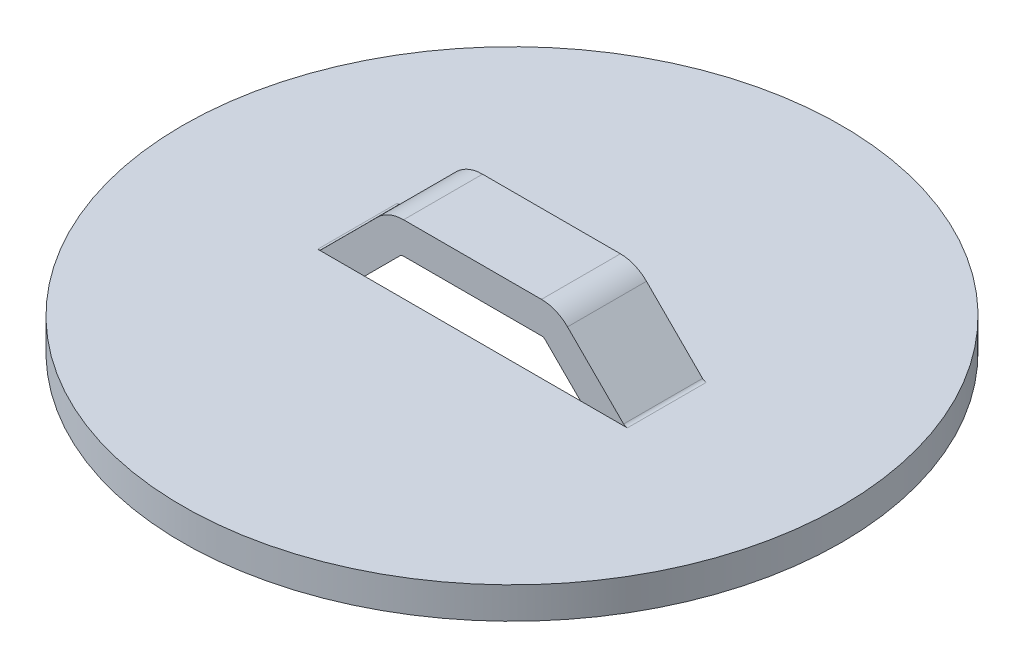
ISO-10303-21;
HEADER;
FILE_DESCRIPTION(('STEP AP214'),'2;1');
FILE_NAME('part.step','',(''),(''),'','','');
FILE_SCHEMA(('AUTOMOTIVE_DESIGN { 1 0 10303 214 1 1 1 1 }'));
ENDSEC;
DATA;
#1=APPLICATION_CONTEXT('core data for automotive mechanical design processes');
#2=APPLICATION_PROTOCOL_DEFINITION('international standard','automotive_design',2000,#1);
#3=PRODUCT_CONTEXT('',#1,'mechanical');
#4=PRODUCT('Part','Part','',(#3));
#5=PRODUCT_RELATED_PRODUCT_CATEGORY('part','',(#4));
#6=PRODUCT_DEFINITION_FORMATION('','',#4);
#7=PRODUCT_DEFINITION_CONTEXT('part definition',#1,'design');
#8=PRODUCT_DEFINITION('design','',#6,#7);
#9=PRODUCT_DEFINITION_SHAPE('','',#8);
#10=(LENGTH_UNIT() NAMED_UNIT(*) SI_UNIT(.MILLI.,.METRE.));
#11=(NAMED_UNIT(*) PLANE_ANGLE_UNIT() SI_UNIT($,.RADIAN.));
#12=(NAMED_UNIT(*) SI_UNIT($,.STERADIAN.) SOLID_ANGLE_UNIT());
#13=UNCERTAINTY_MEASURE_WITH_UNIT(LENGTH_MEASURE(1.E-05),#10,'distance_accuracy_value','');
#14=(GEOMETRIC_REPRESENTATION_CONTEXT(3) GLOBAL_UNCERTAINTY_ASSIGNED_CONTEXT((#13)) GLOBAL_UNIT_ASSIGNED_CONTEXT((#10,
#11,#12)) REPRESENTATION_CONTEXT('',''));
#15=CARTESIAN_POINT('',(0.,0.,0.));
#16=DIRECTION('',(0.,0.,1.));
#17=DIRECTION('',(1.,0.,0.));
#18=AXIS2_PLACEMENT_3D('',#15,#16,#17);
#19=CARTESIAN_POINT('',(-7.47121024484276,0.254,0.));
#20=DIRECTION('',(0.,0.,-1.));
#21=DIRECTION('',(-1.,0.,0.));
#22=AXIS2_PLACEMENT_3D('',#19,#20,#21);
#23=PLANE('',#22);
#24=DIRECTION('',(-1.,0.,0.));
#25=VECTOR('',#24,1.);
#26=CARTESIAN_POINT('',(-7.47121024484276,0.,0.));
#27=LINE('',#26,#25);
#28=CARTESIAN_POINT('',(-5.21073853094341,0.,0.));
#29=VERTEX_POINT('',#28);
#30=CARTESIAN_POINT('',(-7.47121024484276,0.,0.));
#31=VERTEX_POINT('',#30);
#32=EDGE_CURVE('E174',#29,#31,#27,.T.);
#33=ORIENTED_EDGE('',*,*,#32,.F.);
#34=DIRECTION('',(0.707106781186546,0.707106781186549,0.));
#35=VECTOR('',#34,1.);
#36=CARTESIAN_POINT('',(-6.21397438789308,-1.00323585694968,0.));
#37=LINE('',#36,#35);
#38=CARTESIAN_POINT('',(-3.50713340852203,1.70360512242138,0.));
#39=VERTEX_POINT('',#38);
#40=EDGE_CURVE('E219',#39,#29,#37,.F.);
#41=ORIENTED_EDGE('',*,*,#40,.F.);
#42=CARTESIAN_POINT('',(-3.32752828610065,1.524,0.));
#43=DIRECTION('',(0.,0.,1.));
#44=DIRECTION('',(1.,0.,0.));
#45=AXIS2_PLACEMENT_3D('',#42,#43,#44);
#46=CIRCLE('',#45,0.254);
#47=CARTESIAN_POINT('',(-3.32752828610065,1.778,0.));
#48=VERTEX_POINT('',#47);
#49=EDGE_CURVE('E223',#39,#48,#46,.F.);
#50=ORIENTED_EDGE('',*,*,#49,.T.);
#51=DIRECTION('',(1.,0.,0.));
#52=VECTOR('',#51,1.);
#53=CARTESIAN_POINT('',(-3.32752828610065,1.778,0.));
#54=LINE('',#53,#52);
#55=CARTESIAN_POINT('',(3.32752828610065,1.778,0.));
#56=VERTEX_POINT('',#55);
#57=EDGE_CURVE('E224',#56,#48,#54,.F.);
#58=ORIENTED_EDGE('',*,*,#57,.F.);
#59=CARTESIAN_POINT('',(3.32752828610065,1.524,0.));
#60=DIRECTION('',(0.,0.,1.));
#61=DIRECTION('',(1.,0.,0.));
#62=AXIS2_PLACEMENT_3D('',#59,#60,#61);
#63=CIRCLE('',#62,0.253999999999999);
#64=CARTESIAN_POINT('',(3.50713340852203,1.70360512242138,0.));
#65=VERTEX_POINT('',#64);
#66=EDGE_CURVE('E227',#56,#65,#63,.F.);
#67=ORIENTED_EDGE('',*,*,#66,.T.);
#68=DIRECTION('',(0.707106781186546,-0.707106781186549,0.));
#69=VECTOR('',#68,1.);
#70=CARTESIAN_POINT('',(3.50713340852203,1.70360512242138,0.));
#71=LINE('',#70,#69);
#72=CARTESIAN_POINT('',(5.21073853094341,0.,0.));
#73=VERTEX_POINT('',#72);
#74=EDGE_CURVE('E169',#73,#65,#71,.F.);
#75=ORIENTED_EDGE('',*,*,#74,.F.);
#76=CARTESIAN_POINT('',(7.47121024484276,0.,0.));
#77=VERTEX_POINT('',#76);
#78=EDGE_CURVE('E53',#77,#73,#27,.T.);
#79=ORIENTED_EDGE('',*,*,#78,.F.);
#80=CARTESIAN_POINT('',(7.47121024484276,0.254,0.));
#81=DIRECTION('',(0.,0.,1.));
#82=DIRECTION('',(1.,0.,0.));
#83=AXIS2_PLACEMENT_3D('',#80,#81,#82);
#84=CIRCLE('',#83,0.253999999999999);
#85=CARTESIAN_POINT('',(7.29160512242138,0.0743948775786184,0.));
#86=VERTEX_POINT('',#85);
#87=EDGE_CURVE('E166',#77,#86,#84,.F.);
#88=ORIENTED_EDGE('',*,*,#87,.T.);
#89=DIRECTION('',(-0.707106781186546,0.707106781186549,0.));
#90=VECTOR('',#89,1.);
#91=CARTESIAN_POINT('',(4.58476414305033,2.78123585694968,0.));
#92=LINE('',#91,#90);
#93=CARTESIAN_POINT('',(4.58476414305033,2.78123585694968,0.));
#94=VERTEX_POINT('',#93);
#95=EDGE_CURVE('E197',#94,#86,#92,.F.);
#96=ORIENTED_EDGE('',*,*,#95,.F.);
#97=CARTESIAN_POINT('',(3.32752828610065,1.524,0.));
#98=DIRECTION('',(0.,0.,1.));
#99=DIRECTION('',(1.,0.,0.));
#100=AXIS2_PLACEMENT_3D('',#97,#98,#99);
#101=CIRCLE('',#100,1.778);
#102=CARTESIAN_POINT('',(3.32752828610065,3.302,0.));
#103=VERTEX_POINT('',#102);
#104=EDGE_CURVE('E201',#103,#94,#101,.F.);
#105=ORIENTED_EDGE('',*,*,#104,.F.);
#106=DIRECTION('',(1.,0.,0.));
#107=VECTOR('',#106,1.);
#108=CARTESIAN_POINT('',(-3.32752828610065,3.302,0.));
#109=LINE('',#108,#107);
#110=CARTESIAN_POINT('',(-3.32752828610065,3.302,0.));
#111=VERTEX_POINT('',#110);
#112=EDGE_CURVE('E205',#111,#103,#109,.T.);
#113=ORIENTED_EDGE('',*,*,#112,.F.);
#114=CARTESIAN_POINT('',(-3.32752828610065,1.524,0.));
#115=DIRECTION('',(0.,0.,1.));
#116=DIRECTION('',(1.,0.,0.));
#117=AXIS2_PLACEMENT_3D('',#114,#115,#116);
#118=CIRCLE('',#117,1.778);
#119=CARTESIAN_POINT('',(-4.58476414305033,2.78123585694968,0.));
#120=VERTEX_POINT('',#119);
#121=EDGE_CURVE('E209',#120,#111,#118,.F.);
#122=ORIENTED_EDGE('',*,*,#121,.F.);
#123=DIRECTION('',(-0.707106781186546,-0.707106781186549,0.));
#124=VECTOR('',#123,1.);
#125=CARTESIAN_POINT('',(-7.29160512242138,0.0743948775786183,0.));
#126=LINE('',#125,#124);
#127=CARTESIAN_POINT('',(-7.29160512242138,0.0743948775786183,0.));
#128=VERTEX_POINT('',#127);
#129=EDGE_CURVE('E213',#128,#120,#126,.F.);
#130=ORIENTED_EDGE('',*,*,#129,.F.);
#131=CARTESIAN_POINT('',(-7.47121024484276,0.254,0.));
#132=DIRECTION('',(0.,0.,1.));
#133=DIRECTION('',(1.,0.,0.));
#134=AXIS2_PLACEMENT_3D('',#131,#132,#133);
#135=CIRCLE('',#134,0.253999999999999);
#136=EDGE_CURVE('E217',#128,#31,#135,.F.);
#137=ORIENTED_EDGE('',*,*,#136,.T.);
#138=EDGE_LOOP('',(#33,#41,#50,#58,#67,#75,#79,#88,#96,#105,#113,#122,#130,#137));
#139=FACE_BOUND('',#138,.T.);
#140=ADVANCED_FACE('F39',(#139),#23,.F.);
#141=CARTESIAN_POINT('',(-7.47121024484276,0.254,-3.81));
#142=DIRECTION('',(0.,0.,-1.));
#143=DIRECTION('',(-1.,0.,0.));
#144=AXIS2_PLACEMENT_3D('',#141,#142,#143);
#145=PLANE('',#144);
#146=DIRECTION('',(-0.707106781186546,-0.707106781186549,0.));
#147=VECTOR('',#146,1.);
#148=CARTESIAN_POINT('',(-3.50713340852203,1.70360512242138,-3.81));
#149=LINE('',#148,#147);
#150=CARTESIAN_POINT('',(-3.50713340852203,1.70360512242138,-3.81));
#151=VERTEX_POINT('',#150);
#152=CARTESIAN_POINT('',(-5.21073853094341,0.,-3.81));
#153=VERTEX_POINT('',#152);
#154=EDGE_CURVE('E238',#151,#153,#149,.T.);
#155=ORIENTED_EDGE('',*,*,#154,.T.);
#156=DIRECTION('',(1.,0.,0.));
#157=VECTOR('',#156,1.);
#158=CARTESIAN_POINT('',(-7.47121024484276,0.,-3.81));
#159=LINE('',#158,#157);
#160=CARTESIAN_POINT('',(-7.47121024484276,0.,-3.81));
#161=VERTEX_POINT('',#160);
#162=EDGE_CURVE('E285',#161,#153,#159,.T.);
#163=ORIENTED_EDGE('',*,*,#162,.F.);
#164=CARTESIAN_POINT('',(-7.47121024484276,0.254,-3.81));
#165=DIRECTION('',(0.,0.,1.));
#166=DIRECTION('',(1.,0.,0.));
#167=AXIS2_PLACEMENT_3D('',#164,#165,#166);
#168=CIRCLE('',#167,0.253999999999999);
#169=CARTESIAN_POINT('',(-7.29160512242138,0.0743948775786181,-3.81));
#170=VERTEX_POINT('',#169);
#171=EDGE_CURVE('E262',#161,#170,#168,.T.);
#172=ORIENTED_EDGE('',*,*,#171,.T.);
#173=DIRECTION('',(0.707106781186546,0.707106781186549,0.));
#174=VECTOR('',#173,1.);
#175=CARTESIAN_POINT('',(-7.29160512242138,0.074394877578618,-3.81));
#176=LINE('',#175,#174);
#177=CARTESIAN_POINT('',(-4.58476414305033,2.78123585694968,-3.81));
#178=VERTEX_POINT('',#177);
#179=EDGE_CURVE('E261',#170,#178,#176,.T.);
#180=ORIENTED_EDGE('',*,*,#179,.T.);
#181=CARTESIAN_POINT('',(-3.32752828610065,1.524,-3.81));
#182=DIRECTION('',(0.,0.,1.));
#183=DIRECTION('',(1.,0.,0.));
#184=AXIS2_PLACEMENT_3D('',#181,#182,#183);
#185=CIRCLE('',#184,1.778);
#186=CARTESIAN_POINT('',(-3.32752828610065,3.302,-3.81));
#187=VERTEX_POINT('',#186);
#188=EDGE_CURVE('E258',#178,#187,#185,.F.);
#189=ORIENTED_EDGE('',*,*,#188,.T.);
#190=DIRECTION('',(-1.,0.,0.));
#191=VECTOR('',#190,1.);
#192=CARTESIAN_POINT('',(-7.47121024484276,3.302,-3.81));
#193=LINE('',#192,#191);
#194=CARTESIAN_POINT('',(3.32752828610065,3.302,-3.81));
#195=VERTEX_POINT('',#194);
#196=EDGE_CURVE('E257',#187,#195,#193,.F.);
#197=ORIENTED_EDGE('',*,*,#196,.T.);
#198=CARTESIAN_POINT('',(3.32752828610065,1.524,-3.81));
#199=DIRECTION('',(0.,0.,1.));
#200=DIRECTION('',(1.,0.,0.));
#201=AXIS2_PLACEMENT_3D('',#198,#199,#200);
#202=CIRCLE('',#201,1.778);
#203=CARTESIAN_POINT('',(4.58476414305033,2.78123585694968,-3.81));
#204=VERTEX_POINT('',#203);
#205=EDGE_CURVE('E254',#195,#204,#202,.F.);
#206=ORIENTED_EDGE('',*,*,#205,.T.);
#207=DIRECTION('',(0.707106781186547,-0.707106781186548,0.));
#208=VECTOR('',#207,1.);
#209=CARTESIAN_POINT('',(4.58476414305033,2.78123585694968,-3.81));
#210=LINE('',#209,#208);
#211=CARTESIAN_POINT('',(7.29160512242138,0.0743948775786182,-3.81));
#212=VERTEX_POINT('',#211);
#213=EDGE_CURVE('E253',#204,#212,#210,.T.);
#214=ORIENTED_EDGE('',*,*,#213,.T.);
#215=CARTESIAN_POINT('',(7.47121024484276,0.254,-3.81));
#216=DIRECTION('',(0.,0.,1.));
#217=DIRECTION('',(1.,0.,0.));
#218=AXIS2_PLACEMENT_3D('',#215,#216,#217);
#219=CIRCLE('',#218,0.253999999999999);
#220=CARTESIAN_POINT('',(7.47121024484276,0.,-3.81));
#221=VERTEX_POINT('',#220);
#222=EDGE_CURVE('E251',#212,#221,#219,.T.);
#223=ORIENTED_EDGE('',*,*,#222,.T.);
#224=DIRECTION('',(-1.,0.,0.));
#225=VECTOR('',#224,1.);
#226=CARTESIAN_POINT('',(-7.47121024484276,0.,-3.81));
#227=LINE('',#226,#225);
#228=CARTESIAN_POINT('',(5.21073853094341,0.,-3.81));
#229=VERTEX_POINT('',#228);
#230=EDGE_CURVE('E11',#221,#229,#227,.T.);
#231=ORIENTED_EDGE('',*,*,#230,.T.);
#232=DIRECTION('',(-0.707106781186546,0.707106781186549,0.));
#233=VECTOR('',#232,1.);
#234=CARTESIAN_POINT('',(6.21397438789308,-1.00323585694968,-3.81));
#235=LINE('',#234,#233);
#236=CARTESIAN_POINT('',(3.50713340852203,1.70360512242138,-3.81));
#237=VERTEX_POINT('',#236);
#238=EDGE_CURVE('E250',#229,#237,#235,.T.);
#239=ORIENTED_EDGE('',*,*,#238,.T.);
#240=CARTESIAN_POINT('',(3.32752828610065,1.524,-3.81));
#241=DIRECTION('',(0.,0.,1.));
#242=DIRECTION('',(1.,0.,0.));
#243=AXIS2_PLACEMENT_3D('',#240,#241,#242);
#244=CIRCLE('',#243,0.253999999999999);
#245=CARTESIAN_POINT('',(3.32752828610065,1.778,-3.81));
#246=VERTEX_POINT('',#245);
#247=EDGE_CURVE('E243',#237,#246,#244,.T.);
#248=ORIENTED_EDGE('',*,*,#247,.T.);
#249=DIRECTION('',(-1.,0.,0.));
#250=VECTOR('',#249,1.);
#251=CARTESIAN_POINT('',(-7.47121024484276,1.778,-3.81));
#252=LINE('',#251,#250);
#253=CARTESIAN_POINT('',(-3.32752828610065,1.778,-3.81));
#254=VERTEX_POINT('',#253);
#255=EDGE_CURVE('E242',#246,#254,#252,.T.);
#256=ORIENTED_EDGE('',*,*,#255,.T.);
#257=CARTESIAN_POINT('',(-3.32752828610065,1.524,-3.81));
#258=DIRECTION('',(0.,0.,1.));
#259=DIRECTION('',(1.,0.,0.));
#260=AXIS2_PLACEMENT_3D('',#257,#258,#259);
#261=CIRCLE('',#260,0.254);
#262=EDGE_CURVE('E239',#254,#151,#261,.T.);
#263=ORIENTED_EDGE('',*,*,#262,.T.);
#264=EDGE_LOOP('',(#155,#163,#172,#180,#189,#197,#206,#214,#223,#231,#239,#248,#256,#263));
#265=FACE_BOUND('',#264,.T.);
#266=ADVANCED_FACE('F355',(#265),#145,.T.);
#267=CARTESIAN_POINT('',(-7.47121024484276,0.254,-3.81));
#268=DIRECTION('',(0.,0.,1.));
#269=DIRECTION('',(1.,0.,0.));
#270=AXIS2_PLACEMENT_3D('',#267,#268,#269);
#271=CYLINDRICAL_SURFACE('',#270,0.253999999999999);
#272=DIRECTION('',(0.,0.,1.));
#273=VECTOR('',#272,1.);
#274=CARTESIAN_POINT('',(-7.29160512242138,0.0743948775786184,-3.81));
#275=LINE('',#274,#273);
#276=EDGE_CURVE('E210',#170,#128,#275,.T.);
#277=ORIENTED_EDGE('',*,*,#276,.F.);
#278=ORIENTED_EDGE('',*,*,#171,.F.);
#279=DIRECTION('',(0.,0.,1.));
#280=VECTOR('',#279,1.);
#281=CARTESIAN_POINT('',(-7.47121024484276,0.,-3.81));
#282=LINE('',#281,#280);
#283=EDGE_CURVE('E214',#31,#161,#282,.F.);
#284=ORIENTED_EDGE('',*,*,#283,.F.);
#285=ORIENTED_EDGE('',*,*,#136,.F.);
#286=EDGE_LOOP('',(#277,#278,#284,#285));
#287=FACE_BOUND('',#286,.T.);
#288=ADVANCED_FACE('F283',(#287),#271,.F.);
#289=CARTESIAN_POINT('',(-7.29160512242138,0.0743948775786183,-3.81));
#290=DIRECTION('',(-0.707106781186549,0.707106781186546,0.));
#291=DIRECTION('',(-0.707106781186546,-0.707106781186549,0.));
#292=AXIS2_PLACEMENT_3D('',#289,#290,#291);
#293=PLANE('',#292);
#294=ORIENTED_EDGE('',*,*,#179,.F.);
#295=ORIENTED_EDGE('',*,*,#276,.T.);
#296=ORIENTED_EDGE('',*,*,#129,.T.);
#297=DIRECTION('',(0.,0.,1.));
#298=VECTOR('',#297,1.);
#299=CARTESIAN_POINT('',(-4.58476414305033,2.78123585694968,-3.81));
#300=LINE('',#299,#298);
#301=EDGE_CURVE('E206',#178,#120,#300,.T.);
#302=ORIENTED_EDGE('',*,*,#301,.F.);
#303=EDGE_LOOP('',(#294,#295,#296,#302));
#304=FACE_BOUND('',#303,.T.);
#305=ADVANCED_FACE('F364',(#304),#293,.T.);
#306=CARTESIAN_POINT('',(-3.32752828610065,1.524,-3.81));
#307=DIRECTION('',(0.,0.,1.));
#308=DIRECTION('',(1.,0.,0.));
#309=AXIS2_PLACEMENT_3D('',#306,#307,#308);
#310=CYLINDRICAL_SURFACE('',#309,1.778);
#311=ORIENTED_EDGE('',*,*,#188,.F.);
#312=ORIENTED_EDGE('',*,*,#301,.T.);
#313=ORIENTED_EDGE('',*,*,#121,.T.);
#314=DIRECTION('',(0.,0.,1.));
#315=VECTOR('',#314,1.);
#316=CARTESIAN_POINT('',(-3.32752828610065,3.302,-3.81));
#317=LINE('',#316,#315);
#318=EDGE_CURVE('E202',#187,#111,#317,.T.);
#319=ORIENTED_EDGE('',*,*,#318,.F.);
#320=EDGE_LOOP('',(#311,#312,#313,#319));
#321=FACE_BOUND('',#320,.T.);
#322=ADVANCED_FACE('F407',(#321),#310,.T.);
#323=CARTESIAN_POINT('',(-3.32752828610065,3.302,-3.81));
#324=DIRECTION('',(0.,1.,0.));
#325=DIRECTION('',(0.,0.,1.));
#326=AXIS2_PLACEMENT_3D('',#323,#324,#325);
#327=PLANE('',#326);
#328=ORIENTED_EDGE('',*,*,#196,.F.);
#329=ORIENTED_EDGE('',*,*,#318,.T.);
#330=ORIENTED_EDGE('',*,*,#112,.T.);
#331=DIRECTION('',(0.,0.,1.));
#332=VECTOR('',#331,1.);
#333=CARTESIAN_POINT('',(3.32752828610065,3.302,-3.81));
#334=LINE('',#333,#332);
#335=EDGE_CURVE('E198',#195,#103,#334,.T.);
#336=ORIENTED_EDGE('',*,*,#335,.F.);
#337=EDGE_LOOP('',(#328,#329,#330,#336));
#338=FACE_BOUND('',#337,.T.);
#339=ADVANCED_FACE('F403',(#338),#327,.T.);
#340=CARTESIAN_POINT('',(3.32752828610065,1.524,-3.81));
#341=DIRECTION('',(0.,0.,1.));
#342=DIRECTION('',(1.,0.,0.));
#343=AXIS2_PLACEMENT_3D('',#340,#341,#342);
#344=CYLINDRICAL_SURFACE('',#343,1.778);
#345=ORIENTED_EDGE('',*,*,#205,.F.);
#346=ORIENTED_EDGE('',*,*,#335,.T.);
#347=ORIENTED_EDGE('',*,*,#104,.T.);
#348=DIRECTION('',(0.,0.,1.));
#349=VECTOR('',#348,1.);
#350=CARTESIAN_POINT('',(4.58476414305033,2.78123585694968,-3.81));
#351=LINE('',#350,#349);
#352=EDGE_CURVE('E194',#204,#94,#351,.T.);
#353=ORIENTED_EDGE('',*,*,#352,.F.);
#354=EDGE_LOOP('',(#345,#346,#347,#353));
#355=FACE_BOUND('',#354,.T.);
#356=ADVANCED_FACE('F399',(#355),#344,.T.);
#357=CARTESIAN_POINT('',(4.58476414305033,2.78123585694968,-3.81));
#358=DIRECTION('',(0.707106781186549,0.707106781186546,0.));
#359=DIRECTION('',(-0.707106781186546,0.707106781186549,0.));
#360=AXIS2_PLACEMENT_3D('',#357,#358,#359);
#361=PLANE('',#360);
#362=ORIENTED_EDGE('',*,*,#213,.F.);
#363=ORIENTED_EDGE('',*,*,#352,.T.);
#364=ORIENTED_EDGE('',*,*,#95,.T.);
#365=DIRECTION('',(0.,0.,1.));
#366=VECTOR('',#365,1.);
#367=CARTESIAN_POINT('',(7.29160512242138,0.0743948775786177,-3.81));
#368=LINE('',#367,#366);
#369=EDGE_CURVE('E180',#86,#212,#368,.F.);
#370=ORIENTED_EDGE('',*,*,#369,.T.);
#371=EDGE_LOOP('',(#362,#363,#364,#370));
#372=FACE_BOUND('',#371,.T.);
#373=ADVANCED_FACE('F396',(#372),#361,.T.);
#374=CARTESIAN_POINT('',(7.47121024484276,0.254,-3.81));
#375=DIRECTION('',(0.,0.,1.));
#376=DIRECTION('',(1.,0.,0.));
#377=AXIS2_PLACEMENT_3D('',#374,#375,#376);
#378=CYLINDRICAL_SURFACE('',#377,0.253999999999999);
#379=DIRECTION('',(0.,0.,1.));
#380=VECTOR('',#379,1.);
#381=CARTESIAN_POINT('',(7.47121024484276,0.,-3.81));
#382=LINE('',#381,#380);
#383=EDGE_CURVE('E178',#221,#77,#382,.T.);
#384=ORIENTED_EDGE('',*,*,#383,.F.);
#385=ORIENTED_EDGE('',*,*,#222,.F.);
#386=ORIENTED_EDGE('',*,*,#369,.F.);
#387=ORIENTED_EDGE('',*,*,#87,.F.);
#388=EDGE_LOOP('',(#384,#385,#386,#387));
#389=FACE_BOUND('',#388,.T.);
#390=ADVANCED_FACE('F176',(#389),#378,.F.);
#391=CARTESIAN_POINT('',(7.47121024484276,0.,-3.81));
#392=DIRECTION('',(0.,1.,0.));
#393=DIRECTION('',(0.,0.,1.));
#394=AXIS2_PLACEMENT_3D('',#391,#392,#393);
#395=PLANE('',#394);
#396=CARTESIAN_POINT('',(0.,0.,-1.905));
#397=DIRECTION('',(0.,-1.,0.));
#398=DIRECTION('',(1.,0.,0.));
#399=AXIS2_PLACEMENT_3D('',#396,#397,#398);
#400=CIRCLE('',#399,15.905764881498);
#401=CARTESIAN_POINT('',(15.905764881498,0.,-1.905));
#402=VERTEX_POINT('',#401);
#403=EDGE_CURVE('E294',#402,#402,#400,.T.);
#404=ORIENTED_EDGE('',*,*,#403,.F.);
#405=EDGE_LOOP('',(#404));
#406=FACE_BOUND('',#405,.T.);
#407=ORIENTED_EDGE('',*,*,#383,.T.);
#408=ORIENTED_EDGE('',*,*,#78,.T.);
#409=EDGE_CURVE('E172',#73,#29,#27,.T.);
#410=ORIENTED_EDGE('',*,*,#409,.T.);
#411=ORIENTED_EDGE('',*,*,#32,.T.);
#412=ORIENTED_EDGE('',*,*,#283,.T.);
#413=ORIENTED_EDGE('',*,*,#162,.T.);
#414=EDGE_CURVE('E286',#153,#229,#159,.T.);
#415=ORIENTED_EDGE('',*,*,#414,.T.);
#416=ORIENTED_EDGE('',*,*,#230,.F.);
#417=EDGE_LOOP('',(#407,#408,#410,#411,#412,#413,#415,#416));
#418=FACE_BOUND('',#417,.T.);
#419=ADVANCED_FACE('F183',(#406,#418),#395,.T.);
#420=CARTESIAN_POINT('',(7.47121024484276,0.254,-3.81));
#421=DIRECTION('',(0.,0.,1.));
#422=DIRECTION('',(1.,0.,0.));
#423=AXIS2_PLACEMENT_3D('',#420,#421,#422);
#424=CYLINDRICAL_SURFACE('',#423,1.778);
#425=CARTESIAN_POINT('',(7.47121024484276,0.254,-3.81));
#426=DIRECTION('',(0.,0.,1.));
#427=DIRECTION('',(1.,0.,0.));
#428=AXIS2_PLACEMENT_3D('',#425,#426,#427);
#429=CIRCLE('',#428,1.778);
#430=CARTESIAN_POINT('',(7.47121024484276,-1.524,-3.81));
#431=VERTEX_POINT('',#430);
#432=CARTESIAN_POINT('',(6.21397438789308,-1.00323585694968,-3.81));
#433=VERTEX_POINT('',#432);
#434=EDGE_CURVE('E247',#431,#433,#429,.F.);
#435=ORIENTED_EDGE('',*,*,#434,.F.);
#436=DIRECTION('',(0.,0.,1.));
#437=VECTOR('',#436,1.);
#438=CARTESIAN_POINT('',(7.47121024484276,-1.524,-3.81));
#439=LINE('',#438,#437);
#440=CARTESIAN_POINT('',(7.47121024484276,-1.524,0.));
#441=VERTEX_POINT('',#440);
#442=EDGE_CURVE('E188',#431,#441,#439,.T.);
#443=ORIENTED_EDGE('',*,*,#442,.T.);
#444=CARTESIAN_POINT('',(7.47121024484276,0.254,0.));
#445=DIRECTION('',(0.,0.,1.));
#446=DIRECTION('',(1.,0.,0.));
#447=AXIS2_PLACEMENT_3D('',#444,#445,#446);
#448=CIRCLE('',#447,1.778);
#449=CARTESIAN_POINT('',(6.21397438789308,-1.00323585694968,0.));
#450=VERTEX_POINT('',#449);
#451=EDGE_CURVE('E185',#441,#450,#448,.F.);
#452=ORIENTED_EDGE('',*,*,#451,.T.);
#453=DIRECTION('',(0.,0.,1.));
#454=VECTOR('',#453,1.);
#455=CARTESIAN_POINT('',(6.21397438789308,-1.00323585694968,-3.81));
#456=LINE('',#455,#454);
#457=EDGE_CURVE('E230',#433,#450,#456,.T.);
#458=ORIENTED_EDGE('',*,*,#457,.F.);
#459=EDGE_LOOP('',(#435,#443,#452,#458));
#460=FACE_BOUND('',#459,.T.);
#461=ADVANCED_FACE('F328',(#460),#424,.T.);
#462=CARTESIAN_POINT('',(3.50713340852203,1.70360512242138,-3.81));
#463=DIRECTION('',(-0.707106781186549,-0.707106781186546,0.));
#464=DIRECTION('',(0.707106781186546,-0.707106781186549,0.));
#465=AXIS2_PLACEMENT_3D('',#462,#463,#464);
#466=PLANE('',#465);
#467=EDGE_CURVE('E246',#433,#229,#235,.T.);
#468=ORIENTED_EDGE('',*,*,#467,.F.);
#469=ORIENTED_EDGE('',*,*,#457,.T.);
#470=EDGE_CURVE('E228',#450,#73,#71,.F.);
#471=ORIENTED_EDGE('',*,*,#470,.T.);
#472=ORIENTED_EDGE('',*,*,#74,.T.);
#473=DIRECTION('',(0.,0.,1.));
#474=VECTOR('',#473,1.);
#475=CARTESIAN_POINT('',(3.50713340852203,1.70360512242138,-3.81));
#476=LINE('',#475,#474);
#477=EDGE_CURVE('E273',#65,#237,#476,.F.);
#478=ORIENTED_EDGE('',*,*,#477,.T.);
#479=ORIENTED_EDGE('',*,*,#238,.F.);
#480=EDGE_LOOP('',(#468,#469,#471,#472,#478,#479));
#481=FACE_BOUND('',#480,.T.);
#482=ADVANCED_FACE('F325',(#481),#466,.T.);
#483=CARTESIAN_POINT('',(3.32752828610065,1.524,-3.81));
#484=DIRECTION('',(0.,0.,1.));
#485=DIRECTION('',(1.,0.,0.));
#486=AXIS2_PLACEMENT_3D('',#483,#484,#485);
#487=CYLINDRICAL_SURFACE('',#486,0.253999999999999);
#488=DIRECTION('',(0.,0.,1.));
#489=VECTOR('',#488,1.);
#490=CARTESIAN_POINT('',(3.32752828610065,1.778,-3.81));
#491=LINE('',#490,#489);
#492=EDGE_CURVE('E226',#246,#56,#491,.T.);
#493=ORIENTED_EDGE('',*,*,#492,.F.);
#494=ORIENTED_EDGE('',*,*,#247,.F.);
#495=ORIENTED_EDGE('',*,*,#477,.F.);
#496=ORIENTED_EDGE('',*,*,#66,.F.);
#497=EDGE_LOOP('',(#493,#494,#495,#496));
#498=FACE_BOUND('',#497,.T.);
#499=ADVANCED_FACE('F382',(#498),#487,.F.);
#500=CARTESIAN_POINT('',(-3.32752828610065,1.778,-3.81));
#501=DIRECTION('',(0.,-1.,0.));
#502=DIRECTION('',(1.,0.,0.));
#503=AXIS2_PLACEMENT_3D('',#500,#501,#502);
#504=PLANE('',#503);
#505=ORIENTED_EDGE('',*,*,#255,.F.);
#506=ORIENTED_EDGE('',*,*,#492,.T.);
#507=ORIENTED_EDGE('',*,*,#57,.T.);
#508=DIRECTION('',(0.,0.,1.));
#509=VECTOR('',#508,1.);
#510=CARTESIAN_POINT('',(-3.32752828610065,1.778,-3.81));
#511=LINE('',#510,#509);
#512=EDGE_CURVE('E272',#48,#254,#511,.F.);
#513=ORIENTED_EDGE('',*,*,#512,.T.);
#514=EDGE_LOOP('',(#505,#506,#507,#513));
#515=FACE_BOUND('',#514,.T.);
#516=ADVANCED_FACE('F378',(#515),#504,.T.);
#517=CARTESIAN_POINT('',(-3.32752828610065,1.524,-3.81));
#518=DIRECTION('',(0.,0.,1.));
#519=DIRECTION('',(1.,0.,0.));
#520=AXIS2_PLACEMENT_3D('',#517,#518,#519);
#521=CYLINDRICAL_SURFACE('',#520,0.254);
#522=DIRECTION('',(0.,0.,1.));
#523=VECTOR('',#522,1.);
#524=CARTESIAN_POINT('',(-3.50713340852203,1.70360512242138,-3.81));
#525=LINE('',#524,#523);
#526=EDGE_CURVE('E222',#151,#39,#525,.T.);
#527=ORIENTED_EDGE('',*,*,#526,.F.);
#528=ORIENTED_EDGE('',*,*,#262,.F.);
#529=ORIENTED_EDGE('',*,*,#512,.F.);
#530=ORIENTED_EDGE('',*,*,#49,.F.);
#531=EDGE_LOOP('',(#527,#528,#529,#530));
#532=FACE_BOUND('',#531,.T.);
#533=ADVANCED_FACE('F375',(#532),#521,.F.);
#534=CARTESIAN_POINT('',(-6.21397438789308,-1.00323585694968,-3.81));
#535=DIRECTION('',(0.707106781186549,-0.707106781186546,0.));
#536=DIRECTION('',(0.707106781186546,0.707106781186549,0.));
#537=AXIS2_PLACEMENT_3D('',#534,#535,#536);
#538=PLANE('',#537);
#539=ORIENTED_EDGE('',*,*,#154,.F.);
#540=ORIENTED_EDGE('',*,*,#526,.T.);
#541=ORIENTED_EDGE('',*,*,#40,.T.);
#542=DIRECTION('',(-0.707106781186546,-0.707106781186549,0.));
#543=VECTOR('',#542,1.);
#544=CARTESIAN_POINT('',(-6.21397438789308,-1.00323585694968,0.));
#545=LINE('',#544,#543);
#546=CARTESIAN_POINT('',(-6.21397438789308,-1.00323585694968,0.));
#547=VERTEX_POINT('',#546);
#548=EDGE_CURVE('E218',#29,#547,#545,.T.);
#549=ORIENTED_EDGE('',*,*,#548,.T.);
#550=DIRECTION('',(0.,0.,1.));
#551=VECTOR('',#550,1.);
#552=CARTESIAN_POINT('',(-6.21397438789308,-1.00323585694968,-3.81));
#553=LINE('',#552,#551);
#554=CARTESIAN_POINT('',(-6.21397438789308,-1.00323585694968,-3.81));
#555=VERTEX_POINT('',#554);
#556=EDGE_CURVE('E269',#555,#547,#553,.T.);
#557=ORIENTED_EDGE('',*,*,#556,.F.);
#558=EDGE_CURVE('E61',#153,#555,#149,.T.);
#559=ORIENTED_EDGE('',*,*,#558,.F.);
#560=EDGE_LOOP('',(#539,#540,#541,#549,#557,#559));
#561=FACE_BOUND('',#560,.T.);
#562=ADVANCED_FACE('F370',(#561),#538,.T.);
#563=CARTESIAN_POINT('',(-7.47121024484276,0.254,-3.81));
#564=DIRECTION('',(0.,0.,1.));
#565=DIRECTION('',(1.,0.,0.));
#566=AXIS2_PLACEMENT_3D('',#563,#564,#565);
#567=CYLINDRICAL_SURFACE('',#566,1.778);
#568=CARTESIAN_POINT('',(-7.47121024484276,0.254,-3.81));
#569=DIRECTION('',(0.,0.,1.));
#570=DIRECTION('',(1.,0.,0.));
#571=AXIS2_PLACEMENT_3D('',#568,#569,#570);
#572=CIRCLE('',#571,1.778);
#573=CARTESIAN_POINT('',(-7.47121024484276,-1.524,-3.81));
#574=VERTEX_POINT('',#573);
#575=EDGE_CURVE('E46',#555,#574,#572,.F.);
#576=ORIENTED_EDGE('',*,*,#575,.F.);
#577=ORIENTED_EDGE('',*,*,#556,.T.);
#578=CARTESIAN_POINT('',(-7.47121024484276,0.254,0.));
#579=DIRECTION('',(0.,0.,1.));
#580=DIRECTION('',(1.,0.,0.));
#581=AXIS2_PLACEMENT_3D('',#578,#579,#580);
#582=CIRCLE('',#581,1.778);
#583=CARTESIAN_POINT('',(-7.47121024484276,-1.524,0.));
#584=VERTEX_POINT('',#583);
#585=EDGE_CURVE('E266',#547,#584,#582,.F.);
#586=ORIENTED_EDGE('',*,*,#585,.T.);
#587=DIRECTION('',(0.,0.,-1.));
#588=VECTOR('',#587,1.);
#589=CARTESIAN_POINT('',(-7.47121024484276,-1.524,-3.81));
#590=LINE('',#589,#588);
#591=EDGE_CURVE('E265',#574,#584,#590,.F.);
#592=ORIENTED_EDGE('',*,*,#591,.F.);
#593=EDGE_LOOP('',(#576,#577,#586,#592));
#594=FACE_BOUND('',#593,.T.);
#595=ADVANCED_FACE('F340',(#594),#567,.T.);
#596=CARTESIAN_POINT('',(-15.875,-1.524,-3.81));
#597=DIRECTION('',(0.,-1.,0.));
#598=DIRECTION('',(0.,0.,-1.));
#599=AXIS2_PLACEMENT_3D('',#596,#597,#598);
#600=PLANE('',#599);
#601=DIRECTION('',(-1.,0.,0.));
#602=VECTOR('',#601,1.);
#603=CARTESIAN_POINT('',(-7.47121024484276,-1.524,0.));
#604=LINE('',#603,#602);
#605=EDGE_CURVE('E292',#441,#584,#604,.T.);
#606=ORIENTED_EDGE('',*,*,#605,.F.);
#607=ORIENTED_EDGE('',*,*,#442,.F.);
#608=DIRECTION('',(1.,0.,0.));
#609=VECTOR('',#608,1.);
#610=CARTESIAN_POINT('',(-7.47121024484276,-1.524,-3.81));
#611=LINE('',#610,#609);
#612=EDGE_CURVE('E289',#574,#431,#611,.T.);
#613=ORIENTED_EDGE('',*,*,#612,.F.);
#614=ORIENTED_EDGE('',*,*,#591,.T.);
#615=EDGE_LOOP('',(#606,#607,#613,#614));
#616=FACE_BOUND('',#615,.T.);
#617=CARTESIAN_POINT('',(0.,-1.524,-1.905));
#618=DIRECTION('',(0.,-1.,0.));
#619=DIRECTION('',(1.,0.,0.));
#620=AXIS2_PLACEMENT_3D('',#617,#618,#619);
#621=CIRCLE('',#620,15.905764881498);
#622=CARTESIAN_POINT('',(15.905764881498,-1.524,-1.905));
#623=VERTEX_POINT('',#622);
#624=EDGE_CURVE('E171',#623,#623,#621,.T.);
#625=ORIENTED_EDGE('',*,*,#624,.T.);
#626=EDGE_LOOP('',(#625));
#627=FACE_BOUND('',#626,.T.);
#628=ADVANCED_FACE('F335',(#616,#627),#600,.T.);
#629=CARTESIAN_POINT('',(0.,0.,-1.905));
#630=DIRECTION('',(0.,-1.,0.));
#631=DIRECTION('',(1.,0.,0.));
#632=AXIS2_PLACEMENT_3D('',#629,#630,#631);
#633=CYLINDRICAL_SURFACE('',#632,15.905764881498);
#634=ORIENTED_EDGE('',*,*,#624,.F.);
#635=EDGE_LOOP('',(#634));
#636=FACE_BOUND('',#635,.T.);
#637=ORIENTED_EDGE('',*,*,#403,.T.);
#638=EDGE_LOOP('',(#637));
#639=FACE_BOUND('',#638,.T.);
#640=ADVANCED_FACE('F345',(#636,#639),#633,.T.);
#641=CARTESIAN_POINT('',(-7.47121024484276,0.,-3.81));
#642=DIRECTION('',(0.,0.,-1.));
#643=DIRECTION('',(-1.,0.,0.));
#644=AXIS2_PLACEMENT_3D('',#641,#642,#643);
#645=PLANE('',#644);
#646=ORIENTED_EDGE('',*,*,#434,.T.);
#647=ORIENTED_EDGE('',*,*,#467,.T.);
#648=ORIENTED_EDGE('',*,*,#414,.F.);
#649=ORIENTED_EDGE('',*,*,#558,.T.);
#650=ORIENTED_EDGE('',*,*,#575,.T.);
#651=ORIENTED_EDGE('',*,*,#612,.T.);
#652=EDGE_LOOP('',(#646,#647,#648,#649,#650,#651));
#653=FACE_BOUND('',#652,.T.);
#654=ADVANCED_FACE('F342',(#653),#645,.F.);
#655=CARTESIAN_POINT('',(-7.47121024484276,0.,0.));
#656=DIRECTION('',(0.,0.,1.));
#657=DIRECTION('',(1.,0.,0.));
#658=AXIS2_PLACEMENT_3D('',#655,#656,#657);
#659=PLANE('',#658);
#660=ORIENTED_EDGE('',*,*,#451,.F.);
#661=ORIENTED_EDGE('',*,*,#605,.T.);
#662=ORIENTED_EDGE('',*,*,#585,.F.);
#663=ORIENTED_EDGE('',*,*,#548,.F.);
#664=ORIENTED_EDGE('',*,*,#409,.F.);
#665=ORIENTED_EDGE('',*,*,#470,.F.);
#666=EDGE_LOOP('',(#660,#661,#662,#663,#664,#665));
#667=FACE_BOUND('',#666,.T.);
#668=ADVANCED_FACE('F333',(#667),#659,.F.);
#669=CLOSED_SHELL('',(#140,#266,#288,#305,#322,#339,#356,#373,#390,#419,#461,#482,#499,#516,
#533,#562,#595,#628,#640,#654,#668));
#670=MANIFOLD_SOLID_BREP('B2',#669);
#671=ADVANCED_BREP_SHAPE_REPRESENTATION('',(#18,#670),#14);
#672=SHAPE_DEFINITION_REPRESENTATION(#9,#671);
ENDSEC;
END-ISO-10303-21;
